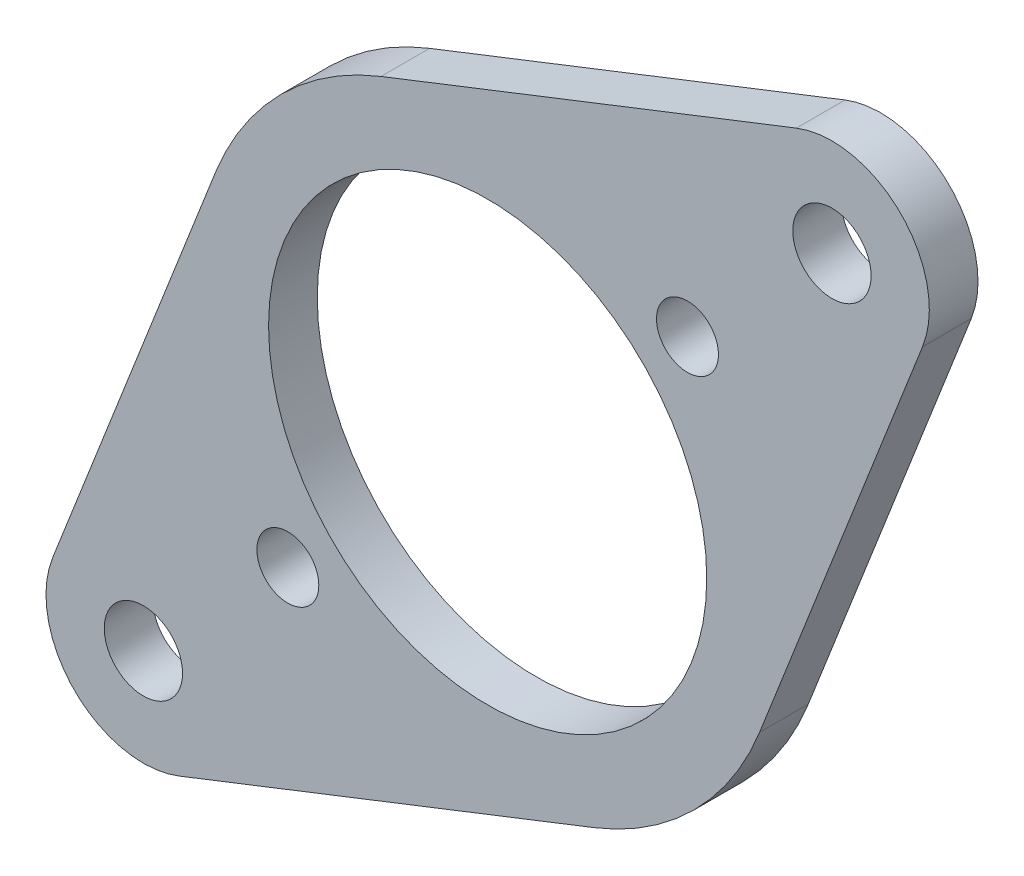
from build123d import *

# Parameters (mm, degrees)
SKETCH1_R           = 14.2875
SKETCH1_R_2         = 2.5527
SKETCH1_R_3         = 2.0193
BOSS_EXTRUDE1_DEPTH = 3.175


with BuildPart() as part:
    # Sketch1 → Boss-Extrude1 (new body)
    with BuildSketch(Plane.XY):
        with BuildLine():
            Line((-6.957657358, 17.733964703), (20.131421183, 28.36196187))
            ThreePointArc((20.131421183, 28.36196187), (26.940768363, 26.940768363), (28.36196187, 20.131421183))
            Line((28.36196187, 20.131421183), (17.733964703, -6.957657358))
            ThreePointArc((17.733964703, -6.957657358), (13.470384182, -13.470384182), (6.957657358, -17.733964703))
            Line((6.957657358, -17.733964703), (-20.131421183, -28.36196187))
            ThreePointArc((-20.131421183, -28.36196187), (-26.940768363, -26.940768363), (-28.36196187, -20.131421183))
            Line((-28.36196187, -20.131421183), (-17.733964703, 6.957657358))
            ThreePointArc((-17.733964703, 6.957657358), (-13.470384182, 13.470384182), (-6.957657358, 17.733964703))
        make_face()
        Circle(SKETCH1_R, mode=Mode.SUBTRACT)
        with Locations((22.450640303, 22.450640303)):
            Circle(SKETCH1_R_2, mode=Mode.SUBTRACT)
        with Locations((-22.450640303, -22.450640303)):
            Circle(SKETCH1_R_2, mode=Mode.SUBTRACT)
        with Locations((-13.030351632, -13.030351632)):
            Circle(SKETCH1_R_3, mode=Mode.SUBTRACT)
        with Locations((13.030351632, 13.030351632)):
            Circle(SKETCH1_R_3, mode=Mode.SUBTRACT)
    extrude(amount=BOSS_EXTRUDE1_DEPTH)


solid = part.part
